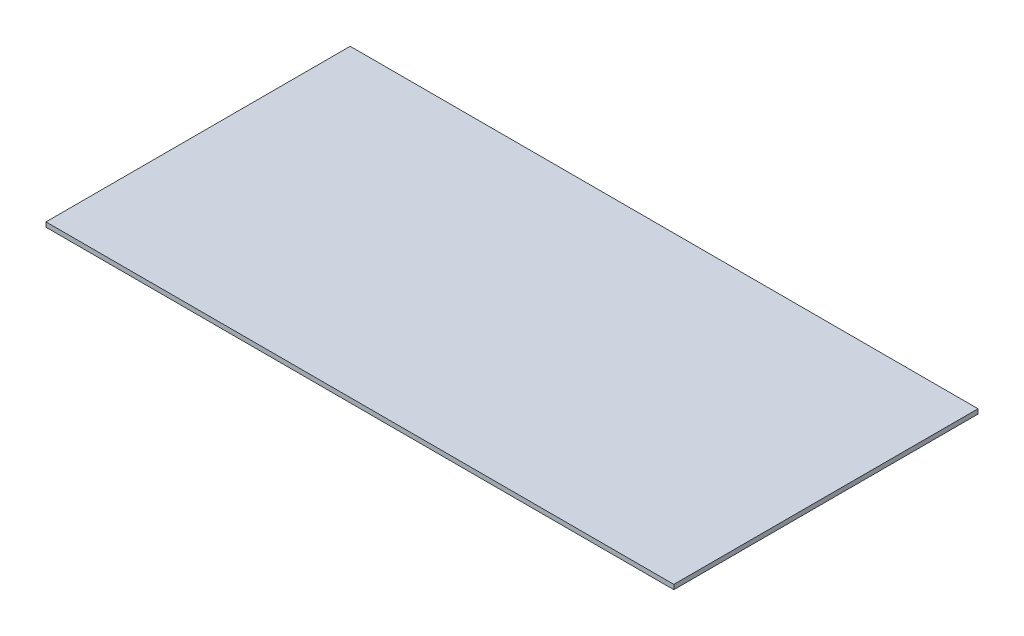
ISO-10303-21;
HEADER;
FILE_DESCRIPTION(('STEP AP214'),'2;1');
FILE_NAME('part.step','',(''),(''),'','','');
FILE_SCHEMA(('AUTOMOTIVE_DESIGN { 1 0 10303 214 1 1 1 1 }'));
ENDSEC;
DATA;
#1=APPLICATION_CONTEXT('core data for automotive mechanical design processes');
#2=APPLICATION_PROTOCOL_DEFINITION('international standard','automotive_design',2000,#1);
#3=PRODUCT_CONTEXT('',#1,'mechanical');
#4=PRODUCT('Part','Part','',(#3));
#5=PRODUCT_RELATED_PRODUCT_CATEGORY('part','',(#4));
#6=PRODUCT_DEFINITION_FORMATION('','',#4);
#7=PRODUCT_DEFINITION_CONTEXT('part definition',#1,'design');
#8=PRODUCT_DEFINITION('design','',#6,#7);
#9=PRODUCT_DEFINITION_SHAPE('','',#8);
#10=(LENGTH_UNIT() NAMED_UNIT(*) SI_UNIT(.MILLI.,.METRE.));
#11=(NAMED_UNIT(*) PLANE_ANGLE_UNIT() SI_UNIT($,.RADIAN.));
#12=(NAMED_UNIT(*) SI_UNIT($,.STERADIAN.) SOLID_ANGLE_UNIT());
#13=UNCERTAINTY_MEASURE_WITH_UNIT(LENGTH_MEASURE(1.E-05),#10,'distance_accuracy_value','');
#14=(GEOMETRIC_REPRESENTATION_CONTEXT(3) GLOBAL_UNCERTAINTY_ASSIGNED_CONTEXT((#13)) GLOBAL_UNIT_ASSIGNED_CONTEXT((#10,
#11,#12)) REPRESENTATION_CONTEXT('',''));
#15=CARTESIAN_POINT('',(0.,0.,0.));
#16=DIRECTION('',(0.,0.,1.));
#17=DIRECTION('',(1.,0.,0.));
#18=AXIS2_PLACEMENT_3D('',#15,#16,#17);
#19=CARTESIAN_POINT('',(0.,3.,0.));
#20=DIRECTION('',(1.,0.,0.));
#21=DIRECTION('',(0.,0.,-1.));
#22=AXIS2_PLACEMENT_3D('',#19,#20,#21);
#23=PLANE('',#22);
#24=DIRECTION('',(0.,0.,1.));
#25=VECTOR('',#24,1.);
#26=CARTESIAN_POINT('',(0.,0.,0.));
#27=LINE('',#26,#25);
#28=CARTESIAN_POINT('',(0.,0.,-196.));
#29=VERTEX_POINT('',#28);
#30=CARTESIAN_POINT('',(0.,0.,0.));
#31=VERTEX_POINT('',#30);
#32=EDGE_CURVE('E95',#29,#31,#27,.T.);
#33=ORIENTED_EDGE('',*,*,#32,.T.);
#34=DIRECTION('',(0.,-1.,0.));
#35=VECTOR('',#34,1.);
#36=CARTESIAN_POINT('',(0.,3.,0.));
#37=LINE('',#36,#35);
#38=CARTESIAN_POINT('',(0.,3.,0.));
#39=VERTEX_POINT('',#38);
#40=EDGE_CURVE('E11',#39,#31,#37,.T.);
#41=ORIENTED_EDGE('',*,*,#40,.F.);
#42=DIRECTION('',(0.,0.,1.));
#43=VECTOR('',#42,1.);
#44=CARTESIAN_POINT('',(0.,3.,0.));
#45=LINE('',#44,#43);
#46=CARTESIAN_POINT('',(0.,3.,-196.));
#47=VERTEX_POINT('',#46);
#48=EDGE_CURVE('E83',#47,#39,#45,.T.);
#49=ORIENTED_EDGE('',*,*,#48,.F.);
#50=DIRECTION('',(0.,-1.,0.));
#51=VECTOR('',#50,1.);
#52=CARTESIAN_POINT('',(0.,3.,-196.));
#53=LINE('',#52,#51);
#54=EDGE_CURVE('E91',#47,#29,#53,.T.);
#55=ORIENTED_EDGE('',*,*,#54,.T.);
#56=EDGE_LOOP('',(#33,#41,#49,#55));
#57=FACE_BOUND('',#56,.T.);
#58=ADVANCED_FACE('F32',(#57),#23,.F.);
#59=CARTESIAN_POINT('',(0.,3.,0.));
#60=DIRECTION('',(0.,0.,-1.));
#61=DIRECTION('',(-1.,0.,0.));
#62=AXIS2_PLACEMENT_3D('',#59,#60,#61);
#63=PLANE('',#62);
#64=DIRECTION('',(1.,0.,0.));
#65=VECTOR('',#64,1.);
#66=CARTESIAN_POINT('',(0.,0.,0.));
#67=LINE('',#66,#65);
#68=CARTESIAN_POINT('',(404.56,0.,0.));
#69=VERTEX_POINT('',#68);
#70=EDGE_CURVE('E87',#31,#69,#67,.T.);
#71=ORIENTED_EDGE('',*,*,#70,.T.);
#72=DIRECTION('',(0.,-1.,0.));
#73=VECTOR('',#72,1.);
#74=CARTESIAN_POINT('',(404.56,3.,0.));
#75=LINE('',#74,#73);
#76=CARTESIAN_POINT('',(404.56,3.,0.));
#77=VERTEX_POINT('',#76);
#78=EDGE_CURVE('E40',#77,#69,#75,.T.);
#79=ORIENTED_EDGE('',*,*,#78,.F.);
#80=DIRECTION('',(1.,0.,0.));
#81=VECTOR('',#80,1.);
#82=CARTESIAN_POINT('',(0.,3.,0.));
#83=LINE('',#82,#81);
#84=EDGE_CURVE('E78',#39,#77,#83,.T.);
#85=ORIENTED_EDGE('',*,*,#84,.F.);
#86=ORIENTED_EDGE('',*,*,#40,.T.);
#87=EDGE_LOOP('',(#71,#79,#85,#86));
#88=FACE_BOUND('',#87,.T.);
#89=ADVANCED_FACE('F86',(#88),#63,.F.);
#90=CARTESIAN_POINT('',(404.56,3.,0.));
#91=DIRECTION('',(-1.,0.,0.));
#92=DIRECTION('',(0.,0.,1.));
#93=AXIS2_PLACEMENT_3D('',#90,#91,#92);
#94=PLANE('',#93);
#95=DIRECTION('',(0.,0.,-1.));
#96=VECTOR('',#95,1.);
#97=CARTESIAN_POINT('',(404.56,0.,0.));
#98=LINE('',#97,#96);
#99=CARTESIAN_POINT('',(404.56,0.,-196.));
#100=VERTEX_POINT('',#99);
#101=EDGE_CURVE('E65',#69,#100,#98,.T.);
#102=ORIENTED_EDGE('',*,*,#101,.T.);
#103=DIRECTION('',(0.,-1.,0.));
#104=VECTOR('',#103,1.);
#105=CARTESIAN_POINT('',(404.56,3.,-196.));
#106=LINE('',#105,#104);
#107=CARTESIAN_POINT('',(404.56,3.,-196.));
#108=VERTEX_POINT('',#107);
#109=EDGE_CURVE('E88',#108,#100,#106,.T.);
#110=ORIENTED_EDGE('',*,*,#109,.F.);
#111=DIRECTION('',(0.,0.,-1.));
#112=VECTOR('',#111,1.);
#113=CARTESIAN_POINT('',(404.56,3.,0.));
#114=LINE('',#113,#112);
#115=EDGE_CURVE('E81',#77,#108,#114,.T.);
#116=ORIENTED_EDGE('',*,*,#115,.F.);
#117=ORIENTED_EDGE('',*,*,#78,.T.);
#118=EDGE_LOOP('',(#102,#110,#116,#117));
#119=FACE_BOUND('',#118,.T.);
#120=ADVANCED_FACE('F89',(#119),#94,.F.);
#121=CARTESIAN_POINT('',(0.,3.,-196.));
#122=DIRECTION('',(0.,0.,1.));
#123=DIRECTION('',(1.,0.,0.));
#124=AXIS2_PLACEMENT_3D('',#121,#122,#123);
#125=PLANE('',#124);
#126=DIRECTION('',(-1.,0.,0.));
#127=VECTOR('',#126,1.);
#128=CARTESIAN_POINT('',(0.,0.,-196.));
#129=LINE('',#128,#127);
#130=EDGE_CURVE('E71',#100,#29,#129,.T.);
#131=ORIENTED_EDGE('',*,*,#130,.T.);
#132=ORIENTED_EDGE('',*,*,#54,.F.);
#133=DIRECTION('',(-1.,0.,0.));
#134=VECTOR('',#133,1.);
#135=CARTESIAN_POINT('',(0.,3.,-196.));
#136=LINE('',#135,#134);
#137=EDGE_CURVE('E48',#108,#47,#136,.T.);
#138=ORIENTED_EDGE('',*,*,#137,.F.);
#139=ORIENTED_EDGE('',*,*,#109,.T.);
#140=EDGE_LOOP('',(#131,#132,#138,#139));
#141=FACE_BOUND('',#140,.T.);
#142=ADVANCED_FACE('F102',(#141),#125,.F.);
#143=CARTESIAN_POINT('',(0.,3.,0.));
#144=DIRECTION('',(0.,-1.,0.));
#145=DIRECTION('',(0.,0.,-1.));
#146=AXIS2_PLACEMENT_3D('',#143,#144,#145);
#147=PLANE('',#146);
#148=ORIENTED_EDGE('',*,*,#48,.T.);
#149=ORIENTED_EDGE('',*,*,#84,.T.);
#150=ORIENTED_EDGE('',*,*,#115,.T.);
#151=ORIENTED_EDGE('',*,*,#137,.T.);
#152=EDGE_LOOP('',(#148,#149,#150,#151));
#153=FACE_BOUND('',#152,.T.);
#154=ADVANCED_FACE('F79',(#153),#147,.F.);
#155=CARTESIAN_POINT('',(0.,0.,0.));
#156=DIRECTION('',(0.,-1.,0.));
#157=DIRECTION('',(0.,0.,-1.));
#158=AXIS2_PLACEMENT_3D('',#155,#156,#157);
#159=PLANE('',#158);
#160=ORIENTED_EDGE('',*,*,#32,.F.);
#161=ORIENTED_EDGE('',*,*,#130,.F.);
#162=ORIENTED_EDGE('',*,*,#101,.F.);
#163=ORIENTED_EDGE('',*,*,#70,.F.);
#164=EDGE_LOOP('',(#160,#161,#162,#163));
#165=FACE_BOUND('',#164,.T.);
#166=ADVANCED_FACE('F105',(#165),#159,.T.);
#167=CLOSED_SHELL('',(#58,#89,#120,#142,#154,#166));
#168=MANIFOLD_SOLID_BREP('B2',#167);
#169=ADVANCED_BREP_SHAPE_REPRESENTATION('',(#18,#168),#14);
#170=SHAPE_DEFINITION_REPRESENTATION(#9,#169);
ENDSEC;
END-ISO-10303-21;
